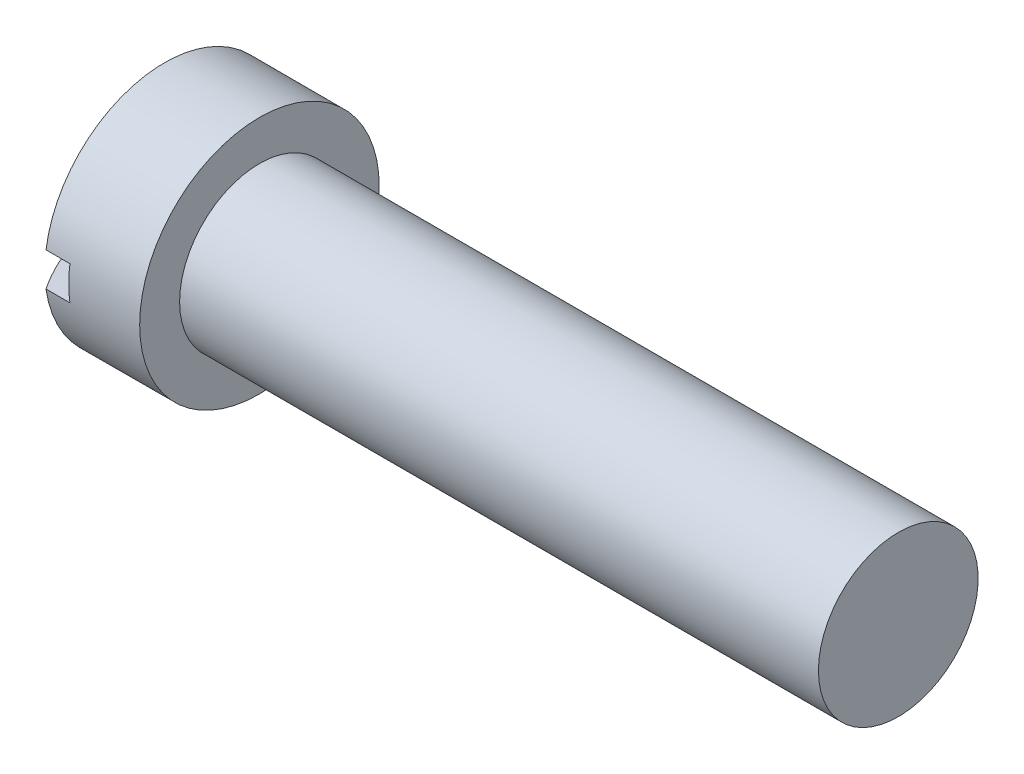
from build123d import *

# Parameters (mm, degrees)
SKETCH2_W  = 19.05
SKETCH2_H  = 2.6924
SLOT_DEPTH = 4.826


with BuildPart() as part:
    # BodySke → Base-Revolve (revolve)
    with BuildSketch(Plane.XY, mode=Mode.PRIVATE) as base_revolve_sk:
        with BuildLine():
            Line((10.4648, 6.35), (10.4648, 9.525))
            Line((10.4648, 9.525), (2.921, 9.525))
            ThreePointArc((2.921, 9.525), (0.746656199, 4.981412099), (0, 0))
            Line((0, 0), (61.2648, 0))
            Line((61.2648, 0), (61.2648, 6.35))
            Line((61.2648, 6.35), (10.4648, 6.35))
        make_face()
    revolve(base_revolve_sk.sketch.rotate(Axis((-25.4, 0, 0), (1, 0, 0)), 90), axis=Axis((-25.4, 0, 0), (1, 0, 0)))

    # Sketch2 → Slot (cut)
    with BuildSketch(Plane(origin=(0, 0, 0), x_dir=(0, 0, -1), z_dir=(1, 0, 0))):
        Rectangle(SKETCH2_W, SKETCH2_H)
    extrude(amount=SLOT_DEPTH, mode=Mode.SUBTRACT)


solid = part.part
